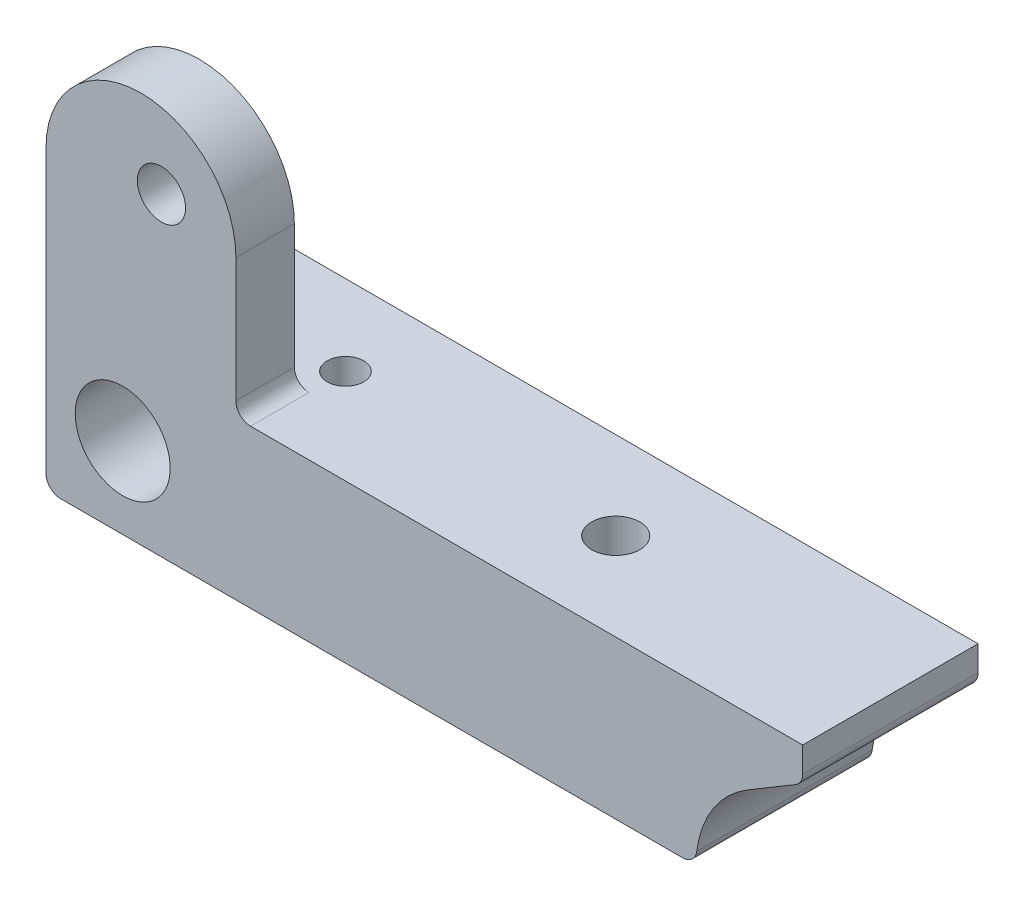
ISO-10303-21;
HEADER;
FILE_DESCRIPTION(('STEP AP214'),'2;1');
FILE_NAME('part.step','',(''),(''),'','','');
FILE_SCHEMA(('AUTOMOTIVE_DESIGN { 1 0 10303 214 1 1 1 1 }'));
ENDSEC;
DATA;
#1=APPLICATION_CONTEXT('core data for automotive mechanical design processes');
#2=APPLICATION_PROTOCOL_DEFINITION('international standard','automotive_design',2000,#1);
#3=PRODUCT_CONTEXT('',#1,'mechanical');
#4=PRODUCT('Part','Part','',(#3));
#5=PRODUCT_RELATED_PRODUCT_CATEGORY('part','',(#4));
#6=PRODUCT_DEFINITION_FORMATION('','',#4);
#7=PRODUCT_DEFINITION_CONTEXT('part definition',#1,'design');
#8=PRODUCT_DEFINITION('design','',#6,#7);
#9=PRODUCT_DEFINITION_SHAPE('','',#8);
#10=(LENGTH_UNIT() NAMED_UNIT(*) SI_UNIT(.MILLI.,.METRE.));
#11=(NAMED_UNIT(*) PLANE_ANGLE_UNIT() SI_UNIT($,.RADIAN.));
#12=(NAMED_UNIT(*) SI_UNIT($,.STERADIAN.) SOLID_ANGLE_UNIT());
#13=UNCERTAINTY_MEASURE_WITH_UNIT(LENGTH_MEASURE(1.E-05),#10,'distance_accuracy_value','');
#14=(GEOMETRIC_REPRESENTATION_CONTEXT(3) GLOBAL_UNCERTAINTY_ASSIGNED_CONTEXT((#13)) GLOBAL_UNIT_ASSIGNED_CONTEXT((#10,
#11,#12)) REPRESENTATION_CONTEXT('',''));
#15=CARTESIAN_POINT('',(0.,0.,0.));
#16=DIRECTION('',(0.,0.,1.));
#17=DIRECTION('',(1.,0.,0.));
#18=AXIS2_PLACEMENT_3D('',#15,#16,#17);
#19=CARTESIAN_POINT('',(-20.65,0.150000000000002,1.05));
#20=DIRECTION('',(0.,0.,-1.));
#21=DIRECTION('',(-1.,0.,0.));
#22=AXIS2_PLACEMENT_3D('',#19,#20,#21);
#23=CYLINDRICAL_SURFACE('',#22,4.);
#24=CARTESIAN_POINT('',(-20.65,0.150000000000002,1.05));
#25=DIRECTION('',(0.,0.,-1.));
#26=DIRECTION('',(-1.,0.,0.));
#27=AXIS2_PLACEMENT_3D('',#24,#25,#26);
#28=CIRCLE('',#27,4.);
#29=CARTESIAN_POINT('',(-24.65,0.150000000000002,1.05));
#30=VERTEX_POINT('',#29);
#31=EDGE_CURVE('E20',#30,#30,#28,.T.);
#32=ORIENTED_EDGE('',*,*,#31,.F.);
#33=EDGE_LOOP('',(#32));
#34=FACE_BOUND('',#33,.T.);
#35=CARTESIAN_POINT('',(-20.65,0.150000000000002,0.));
#36=DIRECTION('',(0.,0.,-1.));
#37=DIRECTION('',(-1.,0.,0.));
#38=AXIS2_PLACEMENT_3D('',#35,#36,#37);
#39=CIRCLE('',#38,4.);
#40=CARTESIAN_POINT('',(-24.65,0.150000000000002,0.));
#41=VERTEX_POINT('',#40);
#42=EDGE_CURVE('E187',#41,#41,#39,.T.);
#43=ORIENTED_EDGE('',*,*,#42,.T.);
#44=EDGE_LOOP('',(#43));
#45=FACE_BOUND('',#44,.T.);
#46=ADVANCED_FACE('F17',(#34,#45),#23,.F.);
#47=CARTESIAN_POINT('',(-20.65,0.150000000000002,1.05));
#48=DIRECTION('',(0.,0.,-1.));
#49=DIRECTION('',(-1.,0.,0.));
#50=AXIS2_PLACEMENT_3D('',#47,#48,#49);
#51=PLANE('',#50);
#52=CARTESIAN_POINT('',(-20.65,0.150000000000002,1.05));
#53=DIRECTION('',(0.,0.,-1.));
#54=DIRECTION('',(-1.,0.,0.));
#55=AXIS2_PLACEMENT_3D('',#52,#53,#54);
#56=CIRCLE('',#55,3.25);
#57=CARTESIAN_POINT('',(-23.9,0.150000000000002,1.05));
#58=VERTEX_POINT('',#57);
#59=EDGE_CURVE('E170',#58,#58,#56,.F.);
#60=ORIENTED_EDGE('',*,*,#59,.T.);
#61=EDGE_LOOP('',(#60));
#62=FACE_BOUND('',#61,.T.);
#63=ORIENTED_EDGE('',*,*,#31,.T.);
#64=EDGE_LOOP('',(#63));
#65=FACE_BOUND('',#64,.T.);
#66=ADVANCED_FACE('F490',(#62,#65),#51,.T.);
#67=CARTESIAN_POINT('',(24.9,3.66790298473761,12.));
#68=DIRECTION('',(0.,0.,-1.));
#69=DIRECTION('',(-1.,0.,0.));
#70=AXIS2_PLACEMENT_3D('',#67,#68,#69);
#71=CYLINDRICAL_SURFACE('',#70,1.);
#72=CARTESIAN_POINT('',(24.9,3.66790298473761,0.));
#73=DIRECTION('',(0.,0.,-1.));
#74=DIRECTION('',(-1.,0.,0.));
#75=AXIS2_PLACEMENT_3D('',#72,#73,#74);
#76=CIRCLE('',#75,1.);
#77=CARTESIAN_POINT('',(25.4122715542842,2.80907945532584,0.));
#78=VERTEX_POINT('',#77);
#79=CARTESIAN_POINT('',(25.9,3.66790298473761,0.));
#80=VERTEX_POINT('',#79);
#81=EDGE_CURVE('E110',#78,#80,#76,.F.);
#82=ORIENTED_EDGE('',*,*,#81,.T.);
#83=DIRECTION('',(0.,0.,1.));
#84=VECTOR('',#83,1.);
#85=CARTESIAN_POINT('',(25.9,3.66790298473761,12.));
#86=LINE('',#85,#84);
#87=CARTESIAN_POINT('',(25.9,3.66790298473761,12.));
#88=VERTEX_POINT('',#87);
#89=EDGE_CURVE('E106',#80,#88,#86,.T.);
#90=ORIENTED_EDGE('',*,*,#89,.T.);
#91=CARTESIAN_POINT('',(24.9,3.66790298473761,12.));
#92=DIRECTION('',(0.,0.,-1.));
#93=DIRECTION('',(-1.,0.,0.));
#94=AXIS2_PLACEMENT_3D('',#91,#92,#93);
#95=CIRCLE('',#94,1.);
#96=CARTESIAN_POINT('',(25.4122715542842,2.80907945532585,12.));
#97=VERTEX_POINT('',#96);
#98=EDGE_CURVE('E94',#88,#97,#95,.T.);
#99=ORIENTED_EDGE('',*,*,#98,.T.);
#100=DIRECTION('',(0.,0.,1.));
#101=VECTOR('',#100,1.);
#102=CARTESIAN_POINT('',(25.4122715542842,2.80907945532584,12.));
#103=LINE('',#102,#101);
#104=EDGE_CURVE('E173',#97,#78,#103,.F.);
#105=ORIENTED_EDGE('',*,*,#104,.T.);
#106=EDGE_LOOP('',(#82,#90,#99,#105));
#107=FACE_BOUND('',#106,.T.);
#108=ADVANCED_FACE('F108',(#107),#71,.T.);
#109=CARTESIAN_POINT('',(25.9,5.4,12.));
#110=DIRECTION('',(-1.,0.,0.));
#111=DIRECTION('',(0.,0.,1.));
#112=AXIS2_PLACEMENT_3D('',#109,#110,#111);
#113=PLANE('',#112);
#114=ORIENTED_EDGE('',*,*,#89,.F.);
#115=DIRECTION('',(0.,1.,0.));
#116=VECTOR('',#115,1.);
#117=CARTESIAN_POINT('',(25.9,0.,0.));
#118=LINE('',#117,#116);
#119=CARTESIAN_POINT('',(25.9,5.4,0.));
#120=VERTEX_POINT('',#119);
#121=EDGE_CURVE('E181',#80,#120,#118,.T.);
#122=ORIENTED_EDGE('',*,*,#121,.T.);
#123=DIRECTION('',(0.,0.,-1.));
#124=VECTOR('',#123,1.);
#125=CARTESIAN_POINT('',(25.9,5.4,12.));
#126=LINE('',#125,#124);
#127=CARTESIAN_POINT('',(25.9,5.4,12.));
#128=VERTEX_POINT('',#127);
#129=EDGE_CURVE('E117',#120,#128,#126,.F.);
#130=ORIENTED_EDGE('',*,*,#129,.T.);
#131=DIRECTION('',(0.,1.,0.));
#132=VECTOR('',#131,1.);
#133=CARTESIAN_POINT('',(25.9,5.4,12.));
#134=LINE('',#133,#132);
#135=EDGE_CURVE('E100',#88,#128,#134,.T.);
#136=ORIENTED_EDGE('',*,*,#135,.F.);
#137=EDGE_LOOP('',(#114,#122,#130,#136));
#138=FACE_BOUND('',#137,.T.);
#139=ADVANCED_FACE('F115',(#138),#113,.F.);
#140=CARTESIAN_POINT('',(-11.9,6.4,12.));
#141=DIRECTION('',(0.,0.,1.));
#142=DIRECTION('',(1.,0.,0.));
#143=AXIS2_PLACEMENT_3D('',#140,#141,#142);
#144=CYLINDRICAL_SURFACE('',#143,1.);
#145=DIRECTION('',(0.,0.,1.));
#146=VECTOR('',#145,1.);
#147=CARTESIAN_POINT('',(-12.9,6.4,8.));
#148=LINE('',#147,#146);
#149=CARTESIAN_POINT('',(-12.9,6.4,12.));
#150=VERTEX_POINT('',#149);
#151=CARTESIAN_POINT('',(-12.9,6.4,8.));
#152=VERTEX_POINT('',#151);
#153=EDGE_CURVE('E213',#150,#152,#148,.F.);
#154=ORIENTED_EDGE('',*,*,#153,.F.);
#155=CARTESIAN_POINT('',(-11.9,6.4,12.));
#156=DIRECTION('',(0.,0.,1.));
#157=DIRECTION('',(1.,0.,0.));
#158=AXIS2_PLACEMENT_3D('',#155,#156,#157);
#159=CIRCLE('',#158,1.);
#160=CARTESIAN_POINT('',(-11.9,5.4,12.));
#161=VERTEX_POINT('',#160);
#162=EDGE_CURVE('E119',#161,#150,#159,.F.);
#163=ORIENTED_EDGE('',*,*,#162,.F.);
#164=DIRECTION('',(0.,0.,-1.));
#165=VECTOR('',#164,1.);
#166=CARTESIAN_POINT('',(-11.9,5.4,12.));
#167=LINE('',#166,#165);
#168=CARTESIAN_POINT('',(-11.9,5.4,8.));
#169=VERTEX_POINT('',#168);
#170=EDGE_CURVE('E214',#161,#169,#167,.T.);
#171=ORIENTED_EDGE('',*,*,#170,.T.);
#172=CARTESIAN_POINT('',(-11.9,6.4,8.));
#173=DIRECTION('',(0.,0.,1.));
#174=DIRECTION('',(1.,0.,0.));
#175=AXIS2_PLACEMENT_3D('',#172,#173,#174);
#176=CIRCLE('',#175,1.);
#177=EDGE_CURVE('E192',#169,#152,#176,.F.);
#178=ORIENTED_EDGE('',*,*,#177,.T.);
#179=EDGE_LOOP('',(#154,#163,#171,#178));
#180=FACE_BOUND('',#179,.T.);
#181=ADVANCED_FACE('F316',(#180),#144,.F.);
#182=CARTESIAN_POINT('',(-24.9,4.4,12.));
#183=DIRECTION('',(0.,0.,-1.));
#184=DIRECTION('',(-1.,0.,0.));
#185=AXIS2_PLACEMENT_3D('',#182,#183,#184);
#186=CYLINDRICAL_SURFACE('',#185,1.);
#187=CARTESIAN_POINT('',(-24.9,4.4,0.));
#188=DIRECTION('',(0.,0.,-1.));
#189=DIRECTION('',(-1.,0.,0.));
#190=AXIS2_PLACEMENT_3D('',#187,#188,#189);
#191=CIRCLE('',#190,1.);
#192=CARTESIAN_POINT('',(-24.9,5.4,0.));
#193=VERTEX_POINT('',#192);
#194=CARTESIAN_POINT('',(-25.9,4.4,0.));
#195=VERTEX_POINT('',#194);
#196=EDGE_CURVE('E185',#193,#195,#191,.F.);
#197=ORIENTED_EDGE('',*,*,#196,.T.);
#198=DIRECTION('',(0.,0.,-1.));
#199=VECTOR('',#198,1.);
#200=CARTESIAN_POINT('',(-25.9,4.4,12.));
#201=LINE('',#200,#199);
#202=CARTESIAN_POINT('',(-25.9,4.4,8.));
#203=VERTEX_POINT('',#202);
#204=EDGE_CURVE('E201',#195,#203,#201,.F.);
#205=ORIENTED_EDGE('',*,*,#204,.T.);
#206=CARTESIAN_POINT('',(-24.9,4.4,8.));
#207=DIRECTION('',(0.,0.,-1.));
#208=DIRECTION('',(-1.,0.,0.));
#209=AXIS2_PLACEMENT_3D('',#206,#207,#208);
#210=CIRCLE('',#209,1.);
#211=CARTESIAN_POINT('',(-24.9,5.4,8.));
#212=VERTEX_POINT('',#211);
#213=EDGE_CURVE('E121',#203,#212,#210,.T.);
#214=ORIENTED_EDGE('',*,*,#213,.T.);
#215=DIRECTION('',(0.,0.,-1.));
#216=VECTOR('',#215,1.);
#217=CARTESIAN_POINT('',(-24.9,5.4,12.));
#218=LINE('',#217,#216);
#219=EDGE_CURVE('E125',#212,#193,#218,.T.);
#220=ORIENTED_EDGE('',*,*,#219,.T.);
#221=EDGE_LOOP('',(#197,#205,#214,#220));
#222=FACE_BOUND('',#221,.T.);
#223=ADVANCED_FACE('F197',(#222),#186,.T.);
#224=CARTESIAN_POINT('',(-19.4,14.9,8.));
#225=DIRECTION('',(0.,0.,1.));
#226=DIRECTION('',(1.,0.,0.));
#227=AXIS2_PLACEMENT_3D('',#224,#225,#226);
#228=PLANE('',#227);
#229=ORIENTED_EDGE('',*,*,#177,.F.);
#230=DIRECTION('',(1.,0.,0.));
#231=VECTOR('',#230,1.);
#232=CARTESIAN_POINT('',(-25.9,5.4,8.));
#233=LINE('',#232,#231);
#234=EDGE_CURVE('E207',#169,#212,#233,.F.);
#235=ORIENTED_EDGE('',*,*,#234,.T.);
#236=ORIENTED_EDGE('',*,*,#213,.F.);
#237=DIRECTION('',(0.,1.,0.));
#238=VECTOR('',#237,1.);
#239=CARTESIAN_POINT('',(-25.9,5.4,8.));
#240=LINE('',#239,#238);
#241=CARTESIAN_POINT('',(-25.9,14.9,8.));
#242=VERTEX_POINT('',#241);
#243=EDGE_CURVE('E157',#203,#242,#240,.T.);
#244=ORIENTED_EDGE('',*,*,#243,.T.);
#245=CARTESIAN_POINT('',(-19.4,14.9,8.));
#246=DIRECTION('',(0.,0.,1.));
#247=DIRECTION('',(1.,0.,0.));
#248=AXIS2_PLACEMENT_3D('',#245,#246,#247);
#249=CIRCLE('',#248,6.5);
#250=CARTESIAN_POINT('',(-12.9,14.9,8.));
#251=VERTEX_POINT('',#250);
#252=EDGE_CURVE('E158',#251,#242,#249,.T.);
#253=ORIENTED_EDGE('',*,*,#252,.F.);
#254=DIRECTION('',(0.,1.,0.));
#255=VECTOR('',#254,1.);
#256=CARTESIAN_POINT('',(-12.9,5.4,8.));
#257=LINE('',#256,#255);
#258=EDGE_CURVE('E266',#152,#251,#257,.T.);
#259=ORIENTED_EDGE('',*,*,#258,.F.);
#260=EDGE_LOOP('',(#229,#235,#236,#244,#253,#259));
#261=FACE_BOUND('',#260,.T.);
#262=CARTESIAN_POINT('',(-18.,16.1,8.));
#263=DIRECTION('',(0.,0.,1.));
#264=DIRECTION('',(1.,0.,0.));
#265=AXIS2_PLACEMENT_3D('',#262,#263,#264);
#266=CIRCLE('',#265,1.65);
#267=CARTESIAN_POINT('',(-16.35,16.1,8.));
#268=VERTEX_POINT('',#267);
#269=EDGE_CURVE('E174',#268,#268,#266,.T.);
#270=ORIENTED_EDGE('',*,*,#269,.T.);
#271=EDGE_LOOP('',(#270));
#272=FACE_BOUND('',#271,.T.);
#273=ADVANCED_FACE('F208',(#261,#272),#228,.F.);
#274=CARTESIAN_POINT('',(-11.9,-5.4,5.5));
#275=DIRECTION('',(0.,1.,0.));
#276=DIRECTION('',(0.,0.,1.));
#277=AXIS2_PLACEMENT_3D('',#274,#275,#276);
#278=CYLINDRICAL_SURFACE('',#277,1.25);
#279=CARTESIAN_POINT('',(-11.9,-5.4,5.5));
#280=DIRECTION('',(0.,1.,0.));
#281=DIRECTION('',(0.,0.,1.));
#282=AXIS2_PLACEMENT_3D('',#279,#280,#281);
#283=CIRCLE('',#282,1.25);
#284=CARTESIAN_POINT('',(-11.9,-5.4,6.75));
#285=VERTEX_POINT('',#284);
#286=EDGE_CURVE('E154',#285,#285,#283,.F.);
#287=ORIENTED_EDGE('',*,*,#286,.T.);
#288=EDGE_LOOP('',(#287));
#289=FACE_BOUND('',#288,.T.);
#290=CARTESIAN_POINT('',(-11.9,5.4,5.5));
#291=DIRECTION('',(0.,1.,0.));
#292=DIRECTION('',(0.,0.,1.));
#293=AXIS2_PLACEMENT_3D('',#290,#291,#292);
#294=CIRCLE('',#293,1.25);
#295=CARTESIAN_POINT('',(-11.9,5.4,6.75));
#296=VERTEX_POINT('',#295);
#297=EDGE_CURVE('E166',#296,#296,#294,.T.);
#298=ORIENTED_EDGE('',*,*,#297,.T.);
#299=EDGE_LOOP('',(#298));
#300=FACE_BOUND('',#299,.T.);
#301=ADVANCED_FACE('F362',(#289,#300),#278,.F.);
#302=CARTESIAN_POINT('',(7.09999999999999,5.4,6.));
#303=DIRECTION('',(0.,1.,0.));
#304=DIRECTION('',(0.,0.,1.));
#305=AXIS2_PLACEMENT_3D('',#302,#303,#304);
#306=CYLINDRICAL_SURFACE('',#305,1.65);
#307=CARTESIAN_POINT('',(7.09999999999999,-5.4,6.));
#308=DIRECTION('',(0.,1.,0.));
#309=DIRECTION('',(0.,0.,1.));
#310=AXIS2_PLACEMENT_3D('',#307,#308,#309);
#311=CIRCLE('',#310,1.65);
#312=CARTESIAN_POINT('',(7.09999999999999,-5.4,7.65));
#313=VERTEX_POINT('',#312);
#314=EDGE_CURVE('E150',#313,#313,#311,.F.);
#315=ORIENTED_EDGE('',*,*,#314,.T.);
#316=EDGE_LOOP('',(#315));
#317=FACE_BOUND('',#316,.T.);
#318=CARTESIAN_POINT('',(7.09999999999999,5.4,6.));
#319=DIRECTION('',(0.,1.,0.));
#320=DIRECTION('',(0.,0.,1.));
#321=AXIS2_PLACEMENT_3D('',#318,#319,#320);
#322=CIRCLE('',#321,1.65);
#323=CARTESIAN_POINT('',(7.09999999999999,5.4,7.65));
#324=VERTEX_POINT('',#323);
#325=EDGE_CURVE('E163',#324,#324,#322,.T.);
#326=ORIENTED_EDGE('',*,*,#325,.T.);
#327=EDGE_LOOP('',(#326));
#328=FACE_BOUND('',#327,.T.);
#329=ADVANCED_FACE('F359',(#317,#328),#306,.F.);
#330=CARTESIAN_POINT('',(-24.9,-4.4,12.));
#331=DIRECTION('',(0.,0.,-1.));
#332=DIRECTION('',(-1.,0.,0.));
#333=AXIS2_PLACEMENT_3D('',#330,#331,#332);
#334=CYLINDRICAL_SURFACE('',#333,1.);
#335=CARTESIAN_POINT('',(-24.9,-4.4,0.));
#336=DIRECTION('',(0.,0.,-1.));
#337=DIRECTION('',(-1.,0.,0.));
#338=AXIS2_PLACEMENT_3D('',#335,#336,#337);
#339=CIRCLE('',#338,1.);
#340=CARTESIAN_POINT('',(-25.9,-4.4,0.));
#341=VERTEX_POINT('',#340);
#342=CARTESIAN_POINT('',(-24.9,-5.4,0.));
#343=VERTEX_POINT('',#342);
#344=EDGE_CURVE('E183',#341,#343,#339,.F.);
#345=ORIENTED_EDGE('',*,*,#344,.T.);
#346=DIRECTION('',(0.,0.,1.));
#347=VECTOR('',#346,1.);
#348=CARTESIAN_POINT('',(-24.9,-5.4,12.));
#349=LINE('',#348,#347);
#350=CARTESIAN_POINT('',(-24.9,-5.4,12.));
#351=VERTEX_POINT('',#350);
#352=EDGE_CURVE('E153',#343,#351,#349,.T.);
#353=ORIENTED_EDGE('',*,*,#352,.T.);
#354=CARTESIAN_POINT('',(-24.9,-4.4,12.));
#355=DIRECTION('',(0.,0.,-1.));
#356=DIRECTION('',(-1.,0.,0.));
#357=AXIS2_PLACEMENT_3D('',#354,#355,#356);
#358=CIRCLE('',#357,1.);
#359=CARTESIAN_POINT('',(-25.9,-4.4,12.));
#360=VERTEX_POINT('',#359);
#361=EDGE_CURVE('E190',#351,#360,#358,.T.);
#362=ORIENTED_EDGE('',*,*,#361,.T.);
#363=DIRECTION('',(0.,0.,-1.));
#364=VECTOR('',#363,1.);
#365=CARTESIAN_POINT('',(-25.9,-4.39999999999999,12.));
#366=LINE('',#365,#364);
#367=EDGE_CURVE('E265',#360,#341,#366,.T.);
#368=ORIENTED_EDGE('',*,*,#367,.T.);
#369=EDGE_LOOP('',(#345,#353,#362,#368));
#370=FACE_BOUND('',#369,.T.);
#371=ADVANCED_FACE('F297',(#370),#334,.T.);
#372=CARTESIAN_POINT('',(0.,0.,0.));
#373=DIRECTION('',(0.,0.,1.));
#374=DIRECTION('',(1.,0.,0.));
#375=AXIS2_PLACEMENT_3D('',#372,#373,#374);
#376=PLANE('',#375);
#377=ORIENTED_EDGE('',*,*,#81,.F.);
#378=DIRECTION('',(-0.858823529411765,-0.51227155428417,0.));
#379=VECTOR('',#378,1.);
#380=CARTESIAN_POINT('',(22.1604176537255,0.869411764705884,0.));
#381=LINE('',#380,#379);
#382=CARTESIAN_POINT('',(22.1604176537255,0.869411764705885,0.));
#383=VERTEX_POINT('',#382);
#384=EDGE_CURVE('E169',#78,#383,#381,.T.);
#385=ORIENTED_EDGE('',*,*,#384,.T.);
#386=CARTESIAN_POINT('',(25.9,-5.4,0.));
#387=DIRECTION('',(0.,0.,-1.));
#388=DIRECTION('',(-1.,0.,0.));
#389=AXIS2_PLACEMENT_3D('',#386,#387,#388);
#390=CIRCLE('',#389,7.3);
#391=CARTESIAN_POINT('',(18.6531766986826,-4.52048192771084,0.));
#392=VERTEX_POINT('',#391);
#393=EDGE_CURVE('E146',#383,#392,#390,.F.);
#394=ORIENTED_EDGE('',*,*,#393,.T.);
#395=CARTESIAN_POINT('',(17.6604611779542,-4.4,0.));
#396=DIRECTION('',(0.,0.,-1.));
#397=DIRECTION('',(-1.,0.,0.));
#398=AXIS2_PLACEMENT_3D('',#395,#396,#397);
#399=CIRCLE('',#398,1.);
#400=CARTESIAN_POINT('',(17.6604611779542,-5.4,0.));
#401=VERTEX_POINT('',#400);
#402=EDGE_CURVE('E177',#401,#392,#399,.F.);
#403=ORIENTED_EDGE('',*,*,#402,.F.);
#404=DIRECTION('',(1.,0.,0.));
#405=VECTOR('',#404,1.);
#406=CARTESIAN_POINT('',(-25.9,-5.4,0.));
#407=LINE('',#406,#405);
#408=EDGE_CURVE('E241',#401,#343,#407,.F.);
#409=ORIENTED_EDGE('',*,*,#408,.T.);
#410=ORIENTED_EDGE('',*,*,#344,.F.);
#411=DIRECTION('',(0.,1.,0.));
#412=VECTOR('',#411,1.);
#413=CARTESIAN_POINT('',(-25.9,5.4,0.));
#414=LINE('',#413,#412);
#415=EDGE_CURVE('E262',#341,#195,#414,.T.);
#416=ORIENTED_EDGE('',*,*,#415,.T.);
#417=ORIENTED_EDGE('',*,*,#196,.F.);
#418=DIRECTION('',(1.,0.,0.));
#419=VECTOR('',#418,1.);
#420=CARTESIAN_POINT('',(-25.9,5.4,0.));
#421=LINE('',#420,#419);
#422=EDGE_CURVE('E129',#193,#120,#421,.T.);
#423=ORIENTED_EDGE('',*,*,#422,.T.);
#424=ORIENTED_EDGE('',*,*,#121,.F.);
#425=EDGE_LOOP('',(#377,#385,#394,#403,#409,#410,#416,#417,#423,#424));
#426=FACE_BOUND('',#425,.T.);
#427=ORIENTED_EDGE('',*,*,#42,.F.);
#428=EDGE_LOOP('',(#427));
#429=FACE_BOUND('',#428,.T.);
#430=ADVANCED_FACE('F219',(#426,#429),#376,.F.);
#431=CARTESIAN_POINT('',(17.6604611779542,-4.4,12.));
#432=DIRECTION('',(0.,0.,-1.));
#433=DIRECTION('',(-1.,0.,0.));
#434=AXIS2_PLACEMENT_3D('',#431,#432,#433);
#435=CYLINDRICAL_SURFACE('',#434,1.);
#436=ORIENTED_EDGE('',*,*,#402,.T.);
#437=DIRECTION('',(0.,0.,-1.));
#438=VECTOR('',#437,1.);
#439=CARTESIAN_POINT('',(18.6531766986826,-4.52048192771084,12.));
#440=LINE('',#439,#438);
#441=CARTESIAN_POINT('',(18.6531766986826,-4.52048192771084,12.));
#442=VERTEX_POINT('',#441);
#443=EDGE_CURVE('E145',#392,#442,#440,.F.);
#444=ORIENTED_EDGE('',*,*,#443,.T.);
#445=CARTESIAN_POINT('',(17.6604611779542,-4.4,12.));
#446=DIRECTION('',(0.,0.,-1.));
#447=DIRECTION('',(-1.,0.,0.));
#448=AXIS2_PLACEMENT_3D('',#445,#446,#447);
#449=CIRCLE('',#448,1.);
#450=CARTESIAN_POINT('',(17.6604611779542,-5.4,12.));
#451=VERTEX_POINT('',#450);
#452=EDGE_CURVE('E34',#442,#451,#449,.T.);
#453=ORIENTED_EDGE('',*,*,#452,.T.);
#454=DIRECTION('',(0.,0.,1.));
#455=VECTOR('',#454,1.);
#456=CARTESIAN_POINT('',(17.6604611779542,-5.4,12.));
#457=LINE('',#456,#455);
#458=EDGE_CURVE('E247',#451,#401,#457,.F.);
#459=ORIENTED_EDGE('',*,*,#458,.T.);
#460=EDGE_LOOP('',(#436,#444,#453,#459));
#461=FACE_BOUND('',#460,.T.);
#462=ADVANCED_FACE('F248',(#461),#435,.T.);
#463=CARTESIAN_POINT('',(-18.,16.1,12.));
#464=DIRECTION('',(0.,0.,1.));
#465=DIRECTION('',(1.,0.,0.));
#466=AXIS2_PLACEMENT_3D('',#463,#464,#465);
#467=CYLINDRICAL_SURFACE('',#466,1.65);
#468=CARTESIAN_POINT('',(-18.,16.1,12.));
#469=DIRECTION('',(0.,0.,1.));
#470=DIRECTION('',(1.,0.,0.));
#471=AXIS2_PLACEMENT_3D('',#468,#469,#470);
#472=CIRCLE('',#471,1.65);
#473=CARTESIAN_POINT('',(-16.35,16.1,12.));
#474=VERTEX_POINT('',#473);
#475=EDGE_CURVE('E142',#474,#474,#472,.F.);
#476=ORIENTED_EDGE('',*,*,#475,.F.);
#477=EDGE_LOOP('',(#476));
#478=FACE_BOUND('',#477,.T.);
#479=ORIENTED_EDGE('',*,*,#269,.F.);
#480=EDGE_LOOP('',(#479));
#481=FACE_BOUND('',#480,.T.);
#482=ADVANCED_FACE('F348',(#478,#481),#467,.F.);
#483=CARTESIAN_POINT('',(-20.65,0.150000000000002,12.));
#484=DIRECTION('',(0.,0.,-1.));
#485=DIRECTION('',(-1.,0.,0.));
#486=AXIS2_PLACEMENT_3D('',#483,#484,#485);
#487=CYLINDRICAL_SURFACE('',#486,3.25);
#488=ORIENTED_EDGE('',*,*,#59,.F.);
#489=EDGE_LOOP('',(#488));
#490=FACE_BOUND('',#489,.T.);
#491=CARTESIAN_POINT('',(-20.65,0.150000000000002,12.));
#492=DIRECTION('',(0.,0.,-1.));
#493=DIRECTION('',(-1.,0.,0.));
#494=AXIS2_PLACEMENT_3D('',#491,#492,#493);
#495=CIRCLE('',#494,3.25);
#496=CARTESIAN_POINT('',(-23.9,0.150000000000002,12.));
#497=VERTEX_POINT('',#496);
#498=EDGE_CURVE('E139',#497,#497,#495,.T.);
#499=ORIENTED_EDGE('',*,*,#498,.F.);
#500=EDGE_LOOP('',(#499));
#501=FACE_BOUND('',#500,.T.);
#502=ADVANCED_FACE('F345',(#490,#501),#487,.F.);
#503=CARTESIAN_POINT('',(22.1604176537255,0.869411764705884,12.));
#504=DIRECTION('',(-0.51227155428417,0.858823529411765,0.));
#505=DIRECTION('',(-0.858823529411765,-0.51227155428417,0.));
#506=AXIS2_PLACEMENT_3D('',#503,#504,#505);
#507=PLANE('',#506);
#508=ORIENTED_EDGE('',*,*,#104,.F.);
#509=DIRECTION('',(0.858823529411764,0.512271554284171,0.));
#510=VECTOR('',#509,1.);
#511=CARTESIAN_POINT('',(22.1604176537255,0.869411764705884,12.));
#512=LINE('',#511,#510);
#513=CARTESIAN_POINT('',(22.1604176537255,0.869411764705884,12.));
#514=VERTEX_POINT('',#513);
#515=EDGE_CURVE('E103',#514,#97,#512,.T.);
#516=ORIENTED_EDGE('',*,*,#515,.F.);
#517=DIRECTION('',(0.,0.,-1.));
#518=VECTOR('',#517,1.);
#519=CARTESIAN_POINT('',(22.1604176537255,0.869411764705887,12.));
#520=LINE('',#519,#518);
#521=EDGE_CURVE('E149',#514,#383,#520,.T.);
#522=ORIENTED_EDGE('',*,*,#521,.T.);
#523=ORIENTED_EDGE('',*,*,#384,.F.);
#524=EDGE_LOOP('',(#508,#516,#522,#523));
#525=FACE_BOUND('',#524,.T.);
#526=ADVANCED_FACE('F286',(#525),#507,.F.);
#527=CARTESIAN_POINT('',(-25.9,5.4,12.));
#528=DIRECTION('',(0.,-1.,0.));
#529=DIRECTION('',(0.,0.,-1.));
#530=AXIS2_PLACEMENT_3D('',#527,#528,#529);
#531=PLANE('',#530);
#532=ORIENTED_EDGE('',*,*,#170,.F.);
#533=DIRECTION('',(1.,0.,0.));
#534=VECTOR('',#533,1.);
#535=CARTESIAN_POINT('',(0.,5.4,12.));
#536=LINE('',#535,#534);
#537=EDGE_CURVE('E309',#128,#161,#536,.F.);
#538=ORIENTED_EDGE('',*,*,#537,.F.);
#539=ORIENTED_EDGE('',*,*,#129,.F.);
#540=ORIENTED_EDGE('',*,*,#422,.F.);
#541=ORIENTED_EDGE('',*,*,#219,.F.);
#542=ORIENTED_EDGE('',*,*,#234,.F.);
#543=EDGE_LOOP('',(#532,#538,#539,#540,#541,#542));
#544=FACE_BOUND('',#543,.T.);
#545=ORIENTED_EDGE('',*,*,#325,.F.);
#546=EDGE_LOOP('',(#545));
#547=FACE_BOUND('',#546,.T.);
#548=ORIENTED_EDGE('',*,*,#297,.F.);
#549=EDGE_LOOP('',(#548));
#550=FACE_BOUND('',#549,.T.);
#551=ADVANCED_FACE('F216',(#544,#547,#550),#531,.F.);
#552=CARTESIAN_POINT('',(-12.9,5.4,8.));
#553=DIRECTION('',(1.,0.,0.));
#554=DIRECTION('',(0.,1.,0.));
#555=AXIS2_PLACEMENT_3D('',#552,#553,#554);
#556=PLANE('',#555);
#557=ORIENTED_EDGE('',*,*,#258,.T.);
#558=DIRECTION('',(0.,0.,1.));
#559=VECTOR('',#558,1.);
#560=CARTESIAN_POINT('',(-12.9,14.9,8.));
#561=LINE('',#560,#559);
#562=CARTESIAN_POINT('',(-12.9,14.9,12.));
#563=VERTEX_POINT('',#562);
#564=EDGE_CURVE('E162',#563,#251,#561,.F.);
#565=ORIENTED_EDGE('',*,*,#564,.F.);
#566=DIRECTION('',(0.,1.,0.));
#567=VECTOR('',#566,1.);
#568=CARTESIAN_POINT('',(-12.9,0.,12.));
#569=LINE('',#568,#567);
#570=EDGE_CURVE('E138',#150,#563,#569,.T.);
#571=ORIENTED_EDGE('',*,*,#570,.F.);
#572=ORIENTED_EDGE('',*,*,#153,.T.);
#573=EDGE_LOOP('',(#557,#565,#571,#572));
#574=FACE_BOUND('',#573,.T.);
#575=ADVANCED_FACE('F308',(#574),#556,.T.);
#576=CARTESIAN_POINT('',(-19.4,14.9,8.));
#577=DIRECTION('',(0.,0.,1.));
#578=DIRECTION('',(1.,0.,0.));
#579=AXIS2_PLACEMENT_3D('',#576,#577,#578);
#580=CYLINDRICAL_SURFACE('',#579,6.5);
#581=ORIENTED_EDGE('',*,*,#252,.T.);
#582=DIRECTION('',(0.,0.,-1.));
#583=VECTOR('',#582,1.);
#584=CARTESIAN_POINT('',(-25.9,14.9,12.));
#585=LINE('',#584,#583);
#586=CARTESIAN_POINT('',(-25.9,14.9,12.));
#587=VERTEX_POINT('',#586);
#588=EDGE_CURVE('E161',#242,#587,#585,.F.);
#589=ORIENTED_EDGE('',*,*,#588,.T.);
#590=CARTESIAN_POINT('',(-19.4,14.9,12.));
#591=DIRECTION('',(0.,0.,1.));
#592=DIRECTION('',(1.,0.,0.));
#593=AXIS2_PLACEMENT_3D('',#590,#591,#592);
#594=CIRCLE('',#593,6.5);
#595=EDGE_CURVE('E134',#563,#587,#594,.T.);
#596=ORIENTED_EDGE('',*,*,#595,.F.);
#597=ORIENTED_EDGE('',*,*,#564,.T.);
#598=EDGE_LOOP('',(#581,#589,#596,#597));
#599=FACE_BOUND('',#598,.T.);
#600=ADVANCED_FACE('F306',(#599),#580,.T.);
#601=CARTESIAN_POINT('',(-25.9,5.4,12.));
#602=DIRECTION('',(1.,0.,0.));
#603=DIRECTION('',(0.,0.,-1.));
#604=AXIS2_PLACEMENT_3D('',#601,#602,#603);
#605=PLANE('',#604);
#606=ORIENTED_EDGE('',*,*,#204,.F.);
#607=ORIENTED_EDGE('',*,*,#415,.F.);
#608=ORIENTED_EDGE('',*,*,#367,.F.);
#609=DIRECTION('',(0.,1.,0.));
#610=VECTOR('',#609,1.);
#611=CARTESIAN_POINT('',(-25.9,0.,12.));
#612=LINE('',#611,#610);
#613=EDGE_CURVE('E137',#587,#360,#612,.F.);
#614=ORIENTED_EDGE('',*,*,#613,.F.);
#615=ORIENTED_EDGE('',*,*,#588,.F.);
#616=ORIENTED_EDGE('',*,*,#243,.F.);
#617=EDGE_LOOP('',(#606,#607,#608,#614,#615,#616));
#618=FACE_BOUND('',#617,.T.);
#619=ADVANCED_FACE('F302',(#618),#605,.F.);
#620=CARTESIAN_POINT('',(-25.9,-5.4,12.));
#621=DIRECTION('',(0.,1.,0.));
#622=DIRECTION('',(0.,0.,1.));
#623=AXIS2_PLACEMENT_3D('',#620,#621,#622);
#624=PLANE('',#623);
#625=ORIENTED_EDGE('',*,*,#458,.F.);
#626=DIRECTION('',(1.,0.,0.));
#627=VECTOR('',#626,1.);
#628=CARTESIAN_POINT('',(0.,-5.4,12.));
#629=LINE('',#628,#627);
#630=EDGE_CURVE('E26',#351,#451,#629,.T.);
#631=ORIENTED_EDGE('',*,*,#630,.F.);
#632=ORIENTED_EDGE('',*,*,#352,.F.);
#633=ORIENTED_EDGE('',*,*,#408,.F.);
#634=EDGE_LOOP('',(#625,#631,#632,#633));
#635=FACE_BOUND('',#634,.T.);
#636=ORIENTED_EDGE('',*,*,#314,.F.);
#637=EDGE_LOOP('',(#636));
#638=FACE_BOUND('',#637,.T.);
#639=ORIENTED_EDGE('',*,*,#286,.F.);
#640=EDGE_LOOP('',(#639));
#641=FACE_BOUND('',#640,.T.);
#642=ADVANCED_FACE('F252',(#635,#638,#641),#624,.F.);
#643=CARTESIAN_POINT('',(25.9,-5.4,12.));
#644=DIRECTION('',(0.,0.,-1.));
#645=DIRECTION('',(-1.,0.,0.));
#646=AXIS2_PLACEMENT_3D('',#643,#644,#645);
#647=CYLINDRICAL_SURFACE('',#646,7.3);
#648=ORIENTED_EDGE('',*,*,#443,.F.);
#649=ORIENTED_EDGE('',*,*,#393,.F.);
#650=ORIENTED_EDGE('',*,*,#521,.F.);
#651=CARTESIAN_POINT('',(25.9,-5.4,12.));
#652=DIRECTION('',(0.,0.,-1.));
#653=DIRECTION('',(-1.,0.,0.));
#654=AXIS2_PLACEMENT_3D('',#651,#652,#653);
#655=CIRCLE('',#654,7.3);
#656=EDGE_CURVE('E11',#442,#514,#655,.T.);
#657=ORIENTED_EDGE('',*,*,#656,.F.);
#658=EDGE_LOOP('',(#648,#649,#650,#657));
#659=FACE_BOUND('',#658,.T.);
#660=ADVANCED_FACE('F289',(#659),#647,.F.);
#661=CARTESIAN_POINT('',(0.,0.,12.));
#662=DIRECTION('',(0.,0.,1.));
#663=DIRECTION('',(1.,0.,0.));
#664=AXIS2_PLACEMENT_3D('',#661,#662,#663);
#665=PLANE('',#664);
#666=ORIENTED_EDGE('',*,*,#452,.F.);
#667=ORIENTED_EDGE('',*,*,#656,.T.);
#668=ORIENTED_EDGE('',*,*,#515,.T.);
#669=ORIENTED_EDGE('',*,*,#98,.F.);
#670=ORIENTED_EDGE('',*,*,#135,.T.);
#671=ORIENTED_EDGE('',*,*,#537,.T.);
#672=ORIENTED_EDGE('',*,*,#162,.T.);
#673=ORIENTED_EDGE('',*,*,#570,.T.);
#674=ORIENTED_EDGE('',*,*,#595,.T.);
#675=ORIENTED_EDGE('',*,*,#613,.T.);
#676=ORIENTED_EDGE('',*,*,#361,.F.);
#677=ORIENTED_EDGE('',*,*,#630,.T.);
#678=EDGE_LOOP('',(#666,#667,#668,#669,#670,#671,#672,#673,#674,#675,#676,#677));
#679=FACE_BOUND('',#678,.T.);
#680=ORIENTED_EDGE('',*,*,#498,.T.);
#681=EDGE_LOOP('',(#680));
#682=FACE_BOUND('',#681,.T.);
#683=ORIENTED_EDGE('',*,*,#475,.T.);
#684=EDGE_LOOP('',(#683));
#685=FACE_BOUND('',#684,.T.);
#686=ADVANCED_FACE('F96',(#679,#682,#685),#665,.T.);
#687=CLOSED_SHELL('',(#46,#66,#108,#139,#181,#223,#273,#301,#329,#371,#430,#462,#482,#502,#526,
#551,#575,#600,#619,#642,#660,#686));
#688=MANIFOLD_SOLID_BREP('B1',#687);
#689=ADVANCED_BREP_SHAPE_REPRESENTATION('',(#18,#688),#14);
#690=SHAPE_DEFINITION_REPRESENTATION(#9,#689);
ENDSEC;
END-ISO-10303-21;
